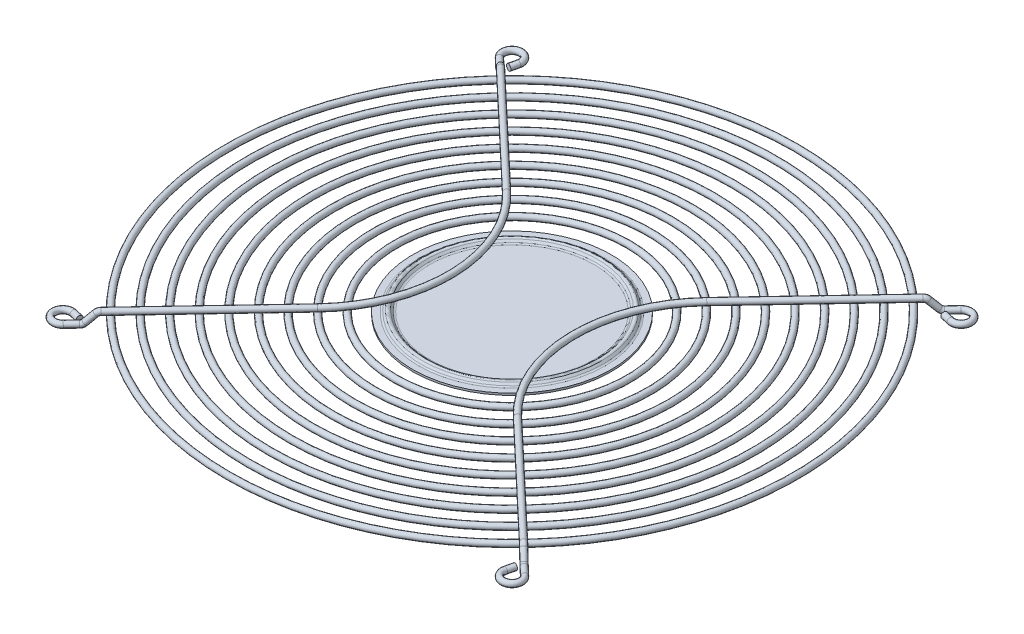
from build123d import *

# Parameters (mm, degrees)
SKETCH1_R               = 1.15
SKETCH3_R               = 1.15
SKETCH5_R               = 1.15
SKETCH7_R               = 1.15
CUT_EXTRUDE1_DEPTH      = 158.320071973
CUT_EXTRUDE1_DEPTH_BACK = 158.320071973
CIRPATTERN1_COUNT       = 4
SKETCH10_R              = 1.15
SKETCH12_R              = 1.15
FILLET1_R               = 1


with BuildPart() as part:
    # Sketch1 → Revolve1 (revolve)
    with BuildSketch(Plane.XY, mode=Mode.PRIVATE) as revolve1_sk:
        with Locations((-45.15, 2.95)):
            Circle(SKETCH1_R)
        with Locations((-110, 2.95)):
            Circle(SKETCH1_R)
        with Locations((-101.89375, 2.95)):
            Circle(SKETCH1_R)
        with Locations((-93.7875, 2.95)):
            Circle(SKETCH1_R)
        with Locations((-77.575, 2.95)):
            Circle(SKETCH1_R)
        with Locations((-69.46875, 2.95)):
            Circle(SKETCH1_R)
        with Locations((-61.3625, 2.95)):
            Circle(SKETCH1_R)
        with Locations((-53.25625, 2.95)):
            Circle(SKETCH1_R)
        with Locations((-85.68125, 2.95)):
            Circle(SKETCH1_R)
    revolve(revolve1_sk.sketch.rotate(Axis((0, 2.95, 0), (0, -1, 0)), 90), axis=Axis((0, 2.95, 0), (0, -1, 0)))



with BuildPart() as body_2:
    # Sweep1: sweep along a path in Sketch2
    with BuildLine(Plane(origin=(0, 0, 0), x_dir=(1, 0, 0), z_dir=(0, 1, 0))) as sweep1_path:
        Line((-81.857835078, 77.390679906), (-38.758851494, 36.643699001))
        ThreePointArc((-38.758851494, 36.643699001), (-27.088757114, 19.949252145), (-22.975, 0))
    # Sketch3 → Sweep1 (sweep)
    with BuildSketch(Plane.XY):
        with Locations((-22.975, 5.25)):
            Circle(SKETCH3_R)
    sweep(path=sweep1_path.line)

    # Sweep2: sweep along a path in Sketch4
    with BuildLine(Plane(origin=(0, 0, 0), x_dir=(0.7266563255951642, 0, 0.6870011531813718), z_dir=(-0.6870011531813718, 0, 0.7266563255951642))) as sweep2_path:
        Line((-122.988200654, 1.15), (-118.488200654, 1.15))
        ThreePointArc((-118.488200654, 1.15), (-117.73542519, 1.297075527), (-117.093364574, 1.716670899))
        Line((-117.093364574, 1.716670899), (-114.044836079, 4.683329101))
        ThreePointArc((-114.044836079, 4.683329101), (-113.402775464, 5.102924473), (-112.65, 5.25))
    # Sketch5 → Sweep2 (sweep)
    with BuildSketch(Plane(origin=(-81.857835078, 0, -77.390679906), x_dir=(-0.6870011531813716, 0, 0.7266563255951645), z_dir=(-0.7266563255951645, 0, -0.6870011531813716))):
        with Locations((0, 5.25)):
            Circle(SKETCH5_R)
    sweep(path=sweep2_path.line)

    # Sweep3: sweep along a path in Sketch6
    with BuildLine(Plane(origin=(0, 0, 0), x_dir=(1, 0, 0), z_dir=(0, 1, 0))) as sweep3_path:
        Line((-83.262425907, 82.837906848), (-82.525104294, 85.934491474))
        ThreePointArc((-82.525104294, 85.934491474), (-88.314690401, 91.408127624), (-90.160205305, 83.657380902))
    # Sketch7 → Sweep3 (sweep)
    with BuildSketch(Plane(origin=(-89.370153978, 0, -84.493035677), x_dir=(-0.6870011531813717, 1.6634550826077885e-15, 0.7266563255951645), z_dir=(-0.7266563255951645, 0, -0.6870011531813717))):
        with Locations((0, 1.15)):
            Circle(SKETCH7_R)
    sweep(path=sweep3_path.line)

    # Sketch8 → Cut-Extrude1 (cut, two sides: drawn at the far end of the back side and taken through both)
    with BuildSketch(Plane(origin=(0, 0, 0), x_dir=(1, 0, 0), z_dir=(0, 1, 0)).offset(-CUT_EXTRUDE1_DEPTH_BACK)):
        Polygon((-335.701392, -277.438998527), (-39.548902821, 35.808044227), (-37.968800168, 37.479353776), (258.183689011, 350.72639653), (884.67777452, -241.578581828), (290.792693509, -869.743976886), align=None)
    extrude(amount=CUT_EXTRUDE1_DEPTH + CUT_EXTRUDE1_DEPTH_BACK, mode=Mode.SUBTRACT)


with BuildPart() as cirpattern1_1:
    # CirPattern1: pattern copy
    add(body_2.part.rotate(Axis((0, 0, 0), (0, 1, 0)), 1 * 360 / CIRPATTERN1_COUNT))


with BuildPart() as cirpattern1_2:
    # CirPattern1: pattern copy
    add(body_2.part.rotate(Axis((0, 0, 0), (0, 1, 0)), 2 * 360 / CIRPATTERN1_COUNT))


with BuildPart() as cirpattern1_3:
    # CirPattern1: pattern copy
    add(body_2.part.rotate(Axis((0, 0, 0), (0, 1, 0)), 3 * 360 / CIRPATTERN1_COUNT))


with BuildPart() as part_1:
    add(part.part)

    add(body_2.part)  # Sweep4 merges body 2

    add(cirpattern1_1.part)  # Sweep4 merges CirPattern1_1
    # Sweep4: sweep along a path in Sketch9
    with BuildLine(Plane(origin=(0, 0, 0), x_dir=(1, 0, 0), z_dir=(0, 1, 0))) as sweep4_path:
        ThreePointArc((-38.758851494, 36.643699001), (-22.084895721, -0.619513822), (-36.643699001, -38.758851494))
    # Sketch10 → Sweep4 (sweep)
    with BuildSketch(Plane(origin=(-38.758851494, 0, -36.643699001), x_dir=(0.6870011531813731, 0, -0.7266563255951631), z_dir=(0.7266563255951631, 0, 0.6870011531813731))):
        with Locations((0, 5.25)):
            Circle(SKETCH10_R)
    sweep(path=sweep4_path.line)


    add(cirpattern1_2.part)  # Sweep5 merges CirPattern1_2

    add(cirpattern1_3.part)  # Sweep5 merges CirPattern1_3
    # Sweep5: sweep along a path in Sketch11
    with BuildLine(Plane(origin=(0, 0, 0), x_dir=(1, 0, 0), z_dir=(0, 1, 0))) as sweep5_path:
        ThreePointArc((36.643699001, 38.758851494), (22.084895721, 0.619513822), (38.758851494, -36.643699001))
    # Sketch12 → Sweep5 (sweep)
    with BuildSketch(Plane(origin=(36.643699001, 0, -38.758851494), x_dir=(0.7266563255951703, 2.0157227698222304e-15, 0.6870011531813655), z_dir=(-0.6870011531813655, 0, 0.7266563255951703))):
        with Locations((0, 5.25)):
            Circle(SKETCH12_R)
    sweep(path=sweep5_path.line)


with BuildPart() as body_2_2:
    # Sketch15 → Revolve-Thin1 (revolve)
    with BuildSketch(Plane.XY, mode=Mode.PRIVATE) as revolve_thin1_sk:
        with BuildLine():
            Line((-38.5, 2.8), (-35.714213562, 2.8))
            Line((-35.714213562, 2.8), (-34.707106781, 3.807106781))
            ThreePointArc((-34.707106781, 3.807106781), (-34, 4.1), (-33.292893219, 3.807106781))
            Line((-33.292893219, 3.807106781), (-32.285786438, 2.8))
            Line((-32.285786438, 2.8), (0, 2.8))
            Line((0, 2.8), (0, 2.05))
            Line((0, 2.05), (-32.596446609, 2.05))
            Line((-32.596446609, 2.05), (-33.823223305, 3.276776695))
            ThreePointArc((-33.823223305, 3.276776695), (-34, 3.35), (-34.176776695, 3.276776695))
            Line((-34.176776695, 3.276776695), (-35.403553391, 2.05))
            Line((-35.403553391, 2.05), (-38.5, 2.05))
            Line((-38.5, 2.05), (-38.5, 2.8))
        make_face()
    revolve(revolve_thin1_sk.sketch.rotate(Axis((0, 2.95, 0), (0, -1, 0)), 270), axis=Axis((0, 2.95, 0), (0, -1, 0)))

    # Fillet1
    fillet1_edges = [body_2_2.edges().sort_by_distance(p)[0] for p in [
        (0, 2.8, -35.714213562),
        (0, 2.05, -35.403553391),
        (0, 2.05, -32.596446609),
        (0, 2.8, -32.285786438),
    ]]
    fillet(fillet1_edges, radius=FILLET1_R)


solid = Compound([part_1.part, body_2_2.part])
